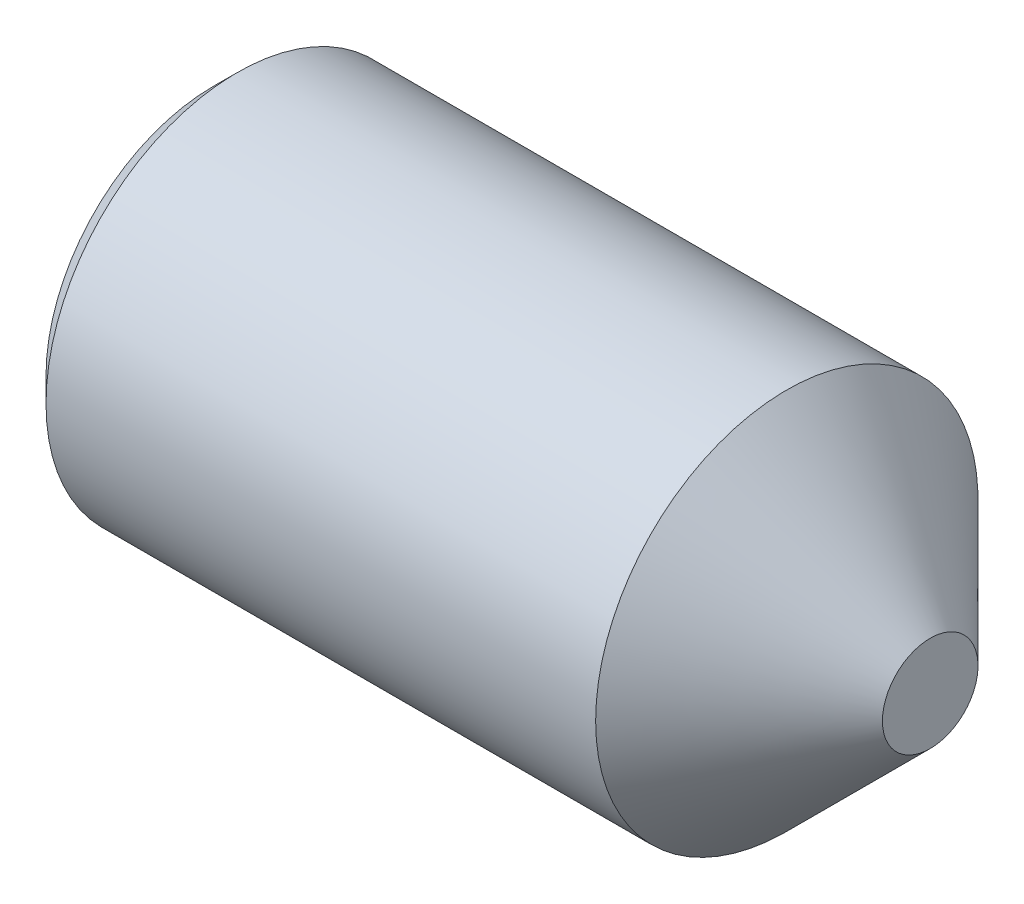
from build123d import *

# Parameters (mm, degrees)
HEXAGONSOCKET_DEPTH = 0.7


with BuildPart() as part:
    # Sketch1 → Base (revolve)
    with BuildSketch(Plane.XY, mode=Mode.PRIVATE) as base_sk:
        Polygon((0, 0), (3, 0), (3, 0.2), (2.4, 0.8), (0.1, 0.8), (0, 0.7), align=None)
    revolve(base_sk.sketch.rotate(Axis((-14.774129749, 0, 0), (1, 0, 0)), 90), axis=Axis((-14.774129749, 0, 0), (1, 0, 0)))

    # Sketch2 → HexagonSocket (cut)
    with BuildSketch(Plane(origin=(0, 0.220293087, -0.139195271), x_dir=(0, 0, 1), z_dir=(-1, 0, 0))):
        Polygon((0.54334046, -0.220293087), (0.341267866, 0.129706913), (-0.062877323, 0.129706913), (-0.264949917, -0.220293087), (-0.062877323, -0.570293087), (0.341267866, -0.570293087), align=None)
    extrude(amount=-HEXAGONSOCKET_DEPTH, mode=Mode.SUBTRACT)

    # Sketch3 → Cut-Revolve (revolve, cut)
    with BuildSketch(Plane.XY, mode=Mode.PRIVATE) as cut_revolve_sk:
        Polygon((0.7, 0.35), (0.902072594, 0), (0.7, 0), align=None)
    revolve(cut_revolve_sk.sketch.rotate(Axis((0.7, 0, 0), (-1, 0, 0)), 180), axis=Axis((0.7, 0, 0), (-1, 0, 0)), mode=Mode.SUBTRACT)


solid = part.part
